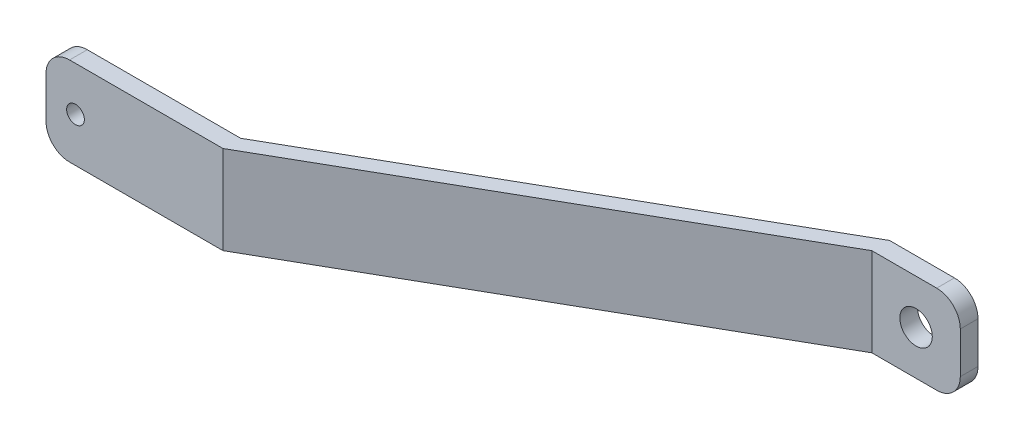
from build123d import *

# Parameters (mm, degrees)
SKETCH1_W           = 30
SKETCH1_H           = 3
SKETCH1_W_2         = 15
BOSS_EXTRUDE1_DEPTH = 15
SKETCH2_R           = 1.5
SKETCH2_R_2         = 2.75
CUT_EXTRUDE1_DEPTH  = 124.689126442
FILLET1_R           = 4
FILLET2_R           = 4


with BuildPart() as part:
    # Sketch1 → Boss-Extrude1 (new body)
    with BuildSketch(Plane(origin=(0, 0, 0), x_dir=(1, 0, 0), z_dir=(0, 1, 0))):
        with Locations((15, 1.5)):
            Rectangle(SKETCH1_W, SKETCH1_H)
        Polygon((100, 40), (30, 0), (30, 3), (100, 43), align=None)
        with Locations((107.5, 41.5)):
            Rectangle(SKETCH1_W_2, SKETCH1_H)
    extrude(amount=BOSS_EXTRUDE1_DEPTH)

    # Sketch2 → Cut-Extrude1 (cut, through all)
    with BuildSketch(Plane.XY):
        with Locations((5, 7.5)):
            Circle(SKETCH2_R)
        with Locations((107.5, 7.5)):
            Circle(SKETCH2_R_2)
    extrude(amount=-CUT_EXTRUDE1_DEPTH, mode=Mode.SUBTRACT)

    # Fillet1
    fillet1_edges = [part.edges().sort_by_distance(p)[0] for p in [
        (0, 15, -1.5),
        (0, 0, -1.5),
    ]]
    fillet(fillet1_edges, radius=FILLET1_R)

    # Fillet2
    fillet2_edges = [part.edges().sort_by_distance(p)[0] for p in [
        (115, 0, -41.5),
        (115, 15, -41.5),
    ]]
    fillet(fillet2_edges, radius=FILLET2_R)


solid = part.part
